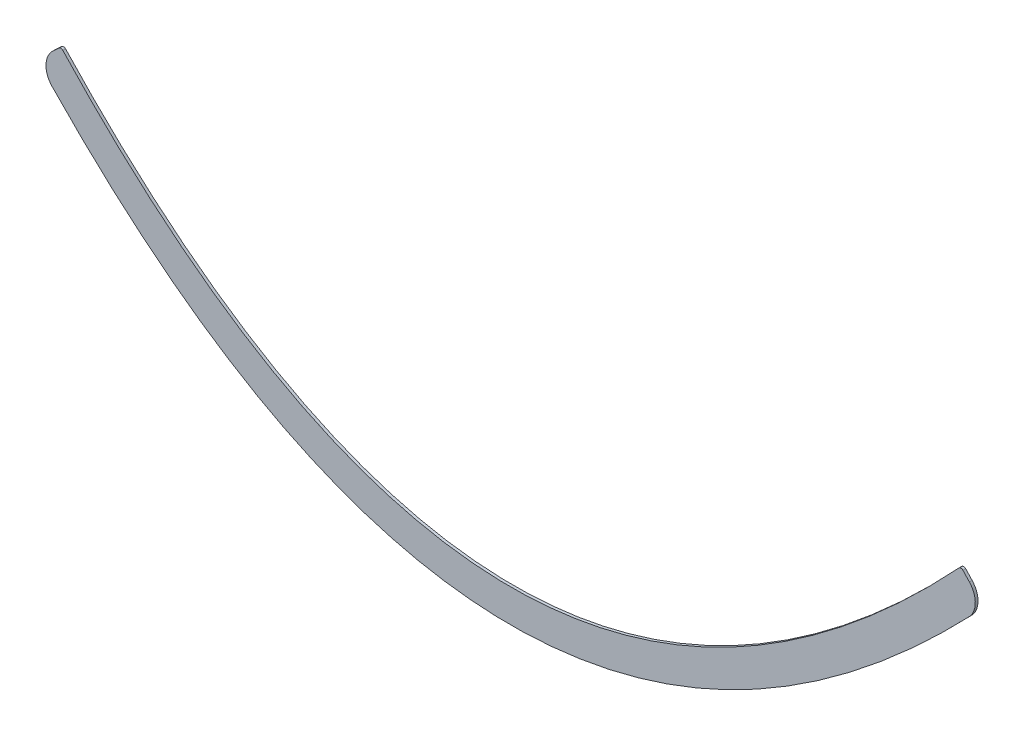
ISO-10303-21;
HEADER;
FILE_DESCRIPTION(('STEP AP214'),'2;1');
FILE_NAME('part.step','',(''),(''),'','','');
FILE_SCHEMA(('AUTOMOTIVE_DESIGN { 1 0 10303 214 1 1 1 1 }'));
ENDSEC;
DATA;
#1=APPLICATION_CONTEXT('core data for automotive mechanical design processes');
#2=APPLICATION_PROTOCOL_DEFINITION('international standard','automotive_design',2000,#1);
#3=PRODUCT_CONTEXT('',#1,'mechanical');
#4=PRODUCT('Part','Part','',(#3));
#5=PRODUCT_RELATED_PRODUCT_CATEGORY('part','',(#4));
#6=PRODUCT_DEFINITION_FORMATION('','',#4);
#7=PRODUCT_DEFINITION_CONTEXT('part definition',#1,'design');
#8=PRODUCT_DEFINITION('design','',#6,#7);
#9=PRODUCT_DEFINITION_SHAPE('','',#8);
#10=(LENGTH_UNIT() NAMED_UNIT(*) SI_UNIT(.MILLI.,.METRE.));
#11=(NAMED_UNIT(*) PLANE_ANGLE_UNIT() SI_UNIT($,.RADIAN.));
#12=(NAMED_UNIT(*) SI_UNIT($,.STERADIAN.) SOLID_ANGLE_UNIT());
#13=UNCERTAINTY_MEASURE_WITH_UNIT(LENGTH_MEASURE(1.E-05),#10,'distance_accuracy_value','');
#14=(GEOMETRIC_REPRESENTATION_CONTEXT(3) GLOBAL_UNCERTAINTY_ASSIGNED_CONTEXT((#13)) GLOBAL_UNIT_ASSIGNED_CONTEXT((#10,
#11,#12)) REPRESENTATION_CONTEXT('',''));
#15=CARTESIAN_POINT('',(0.,0.,0.));
#16=DIRECTION('',(0.,0.,1.));
#17=DIRECTION('',(1.,0.,0.));
#18=AXIS2_PLACEMENT_3D('',#15,#16,#17);
#19=CARTESIAN_POINT('',(-5.08738860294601,-74.1901727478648,6.35));
#20=CARTESIAN_POINT('',(-2.31868248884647,-77.1774609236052,6.35));
#21=CARTESIAN_POINT('',(3.23818191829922,-83.1496847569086,6.35));
#22=CARTESIAN_POINT('',(14.3358349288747,-94.983368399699,6.35));
#23=CARTESIAN_POINT('',(28.2210952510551,-109.614438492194,6.35));
#24=CARTESIAN_POINT('',(44.891224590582,-126.899363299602,6.35));
#25=CARTESIAN_POINT('',(67.1336775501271,-149.587882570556,6.35));
#26=CARTESIAN_POINT('',(94.9645082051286,-177.274594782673,6.35));
#27=CARTESIAN_POINT('',(128.408943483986,-209.420308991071,6.35));
#28=CARTESIAN_POINT('',(161.903010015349,-240.486507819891,6.35));
#29=CARTESIAN_POINT('',(206.631237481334,-280.467236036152,6.35));
#30=CARTESIAN_POINT('',(262.677880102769,-327.738120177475,6.35));
#31=CARTESIAN_POINT('',(330.171686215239,-380.121126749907,6.35));
#32=CARTESIAN_POINT('',(397.922207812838,-428.14340045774,6.35));
#33=CARTESIAN_POINT('',(465.946568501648,-471.781311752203,6.35));
#34=CARTESIAN_POINT('',(557.028254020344,-524.080170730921,6.35));
#35=CARTESIAN_POINT('',(671.622867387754,-578.335298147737,6.35));
#36=CARTESIAN_POINT('',(810.300353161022,-625.320226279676,6.35));
#37=CARTESIAN_POINT('',(949.935563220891,-653.821301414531,6.35));
#38=CARTESIAN_POINT('',(1090.12288330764,-663.54653584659,6.35));
#39=CARTESIAN_POINT('',(1230.31865120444,-654.380143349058,6.35));
#40=CARTESIAN_POINT('',(1369.9769622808,-626.431500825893,6.35));
#41=CARTESIAN_POINT('',(1508.68677291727,-579.988786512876,6.35));
#42=CARTESIAN_POINT('',(1623.3110293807,-526.176586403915,6.35));
#43=CARTESIAN_POINT('',(1714.41582364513,-474.227622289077,6.35));
#44=CARTESIAN_POINT('',(1782.45686511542,-430.850236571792,6.35));
#45=CARTESIAN_POINT('',(1850.22315077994,-383.086915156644,6.35));
#46=CARTESIAN_POINT('',(1917.73164818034,-330.961603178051,6.35));
#47=CARTESIAN_POINT('',(1973.78957422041,-283.904654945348,6.35));
#48=CARTESIAN_POINT('',(2018.52624486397,-244.094714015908,6.35));
#49=CARTESIAN_POINT('',(2052.02635465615,-213.156451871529,6.35));
#50=CARTESIAN_POINT('',(2085.47654815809,-181.138545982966,6.35));
#51=CARTESIAN_POINT('',(2113.31194486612,-153.558252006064,6.35));
#52=CARTESIAN_POINT('',(2135.55791489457,-130.954825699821,6.35));
#53=CARTESIAN_POINT('',(2152.23061523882,-113.73369854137,6.35));
#54=CARTESIAN_POINT('',(2166.11796316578,-99.1557887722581,6.35));
#55=CARTESIAN_POINT('',(2177.21725420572,-87.3646044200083,6.35));
#56=CARTESIAN_POINT('',(2182.77492650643,-81.4136672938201,6.35));
#57=CARTESIAN_POINT('',(2185.54403435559,-78.4369843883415,6.35));
#58=B_SPLINE_CURVE_WITH_KNOTS('',3,(#19,#20,#21,#22,#23,#24,#25,#26,#27,#28,#29,#30,#31,#32,#33,
#34,#35,#36,#37,#38,#39,#40,#41,#42,#43,#44,#45,#46,#47,#48,#49,#50,#51,#52,#53,#54,#55,#56,
#57),.UNSPECIFIED.,.F.,.F.,(4,1,1,1,1,1,1,1,1,1,1,1,1,1,1,1,1,1,1,1,1,1,1,1,1,1,1,1,1,1,1,1,1,1,
1,1,4),(0.488148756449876,0.48824117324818,0.488333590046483,0.488518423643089,
0.488703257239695,0.488888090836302,0.489257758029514,0.489627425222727,0.48999709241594,
0.490366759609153,0.491106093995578,0.491845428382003,0.492584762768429,0.493324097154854,
0.494063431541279,0.49554210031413,0.497020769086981,0.498499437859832,0.499978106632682,
0.501456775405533,0.502935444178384,0.504414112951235,0.505892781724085,0.506632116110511,
0.507371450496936,0.508110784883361,0.508850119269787,0.509589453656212,0.509959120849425,
0.510328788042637,0.51069845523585,0.511068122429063,0.511252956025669,0.511437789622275,
0.511622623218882,0.511715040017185,0.511807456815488),.UNSPECIFIED.);
#59=DIRECTION('',(0.,0.,-1.));
#60=VECTOR('',#59,1.);
#61=SURFACE_OF_LINEAR_EXTRUSION('',#58,#60);
#62=CARTESIAN_POINT('',(-5.08738860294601,-74.1901727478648,0.));
#63=CARTESIAN_POINT('',(-2.31868248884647,-77.1774609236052,0.));
#64=CARTESIAN_POINT('',(3.23818191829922,-83.1496847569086,0.));
#65=CARTESIAN_POINT('',(14.3358349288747,-94.983368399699,0.));
#66=CARTESIAN_POINT('',(28.2210952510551,-109.614438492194,0.));
#67=CARTESIAN_POINT('',(44.891224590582,-126.899363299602,0.));
#68=CARTESIAN_POINT('',(67.1336775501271,-149.587882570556,0.));
#69=CARTESIAN_POINT('',(94.9645082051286,-177.274594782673,0.));
#70=CARTESIAN_POINT('',(128.408943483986,-209.420308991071,0.));
#71=CARTESIAN_POINT('',(161.903010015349,-240.486507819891,0.));
#72=CARTESIAN_POINT('',(206.631237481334,-280.467236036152,0.));
#73=CARTESIAN_POINT('',(262.677880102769,-327.738120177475,0.));
#74=CARTESIAN_POINT('',(330.171686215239,-380.121126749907,0.));
#75=CARTESIAN_POINT('',(397.922207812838,-428.14340045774,0.));
#76=CARTESIAN_POINT('',(465.946568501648,-471.781311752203,0.));
#77=CARTESIAN_POINT('',(557.028254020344,-524.080170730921,0.));
#78=CARTESIAN_POINT('',(671.622867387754,-578.335298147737,0.));
#79=CARTESIAN_POINT('',(810.300353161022,-625.320226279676,0.));
#80=CARTESIAN_POINT('',(949.935563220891,-653.821301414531,0.));
#81=CARTESIAN_POINT('',(1090.12288330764,-663.54653584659,0.));
#82=CARTESIAN_POINT('',(1230.31865120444,-654.380143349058,0.));
#83=CARTESIAN_POINT('',(1369.9769622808,-626.431500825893,0.));
#84=CARTESIAN_POINT('',(1508.68677291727,-579.988786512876,0.));
#85=CARTESIAN_POINT('',(1623.3110293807,-526.176586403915,0.));
#86=CARTESIAN_POINT('',(1714.41582364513,-474.227622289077,0.));
#87=CARTESIAN_POINT('',(1782.45686511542,-430.850236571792,0.));
#88=CARTESIAN_POINT('',(1850.22315077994,-383.086915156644,0.));
#89=CARTESIAN_POINT('',(1917.73164818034,-330.961603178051,0.));
#90=CARTESIAN_POINT('',(1973.78957422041,-283.904654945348,0.));
#91=CARTESIAN_POINT('',(2018.52624486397,-244.094714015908,0.));
#92=CARTESIAN_POINT('',(2052.02635465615,-213.156451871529,0.));
#93=CARTESIAN_POINT('',(2085.47654815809,-181.138545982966,0.));
#94=CARTESIAN_POINT('',(2113.31194486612,-153.558252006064,0.));
#95=CARTESIAN_POINT('',(2135.55791489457,-130.954825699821,0.));
#96=CARTESIAN_POINT('',(2152.23061523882,-113.73369854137,0.));
#97=CARTESIAN_POINT('',(2166.11796316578,-99.1557887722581,0.));
#98=CARTESIAN_POINT('',(2177.21725420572,-87.3646044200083,0.));
#99=CARTESIAN_POINT('',(2182.77492650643,-81.4136672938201,0.));
#100=CARTESIAN_POINT('',(2185.54403435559,-78.4369843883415,0.));
#101=B_SPLINE_CURVE_WITH_KNOTS('',3,(#62,#63,#64,#65,#66,#67,#68,#69,#70,#71,#72,#73,#74,#75,
#76,#77,#78,#79,#80,#81,#82,#83,#84,#85,#86,#87,#88,#89,#90,#91,#92,#93,#94,#95,#96,#97,#98,#99,
#100),.UNSPECIFIED.,.F.,.F.,(4,1,1,1,1,1,1,1,1,1,1,1,1,1,1,1,1,1,1,1,1,1,1,1,1,1,1,1,1,1,1,1,1,
1,1,1,4),(0.488148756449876,0.48824117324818,0.488333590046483,0.488518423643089,
0.488703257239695,0.488888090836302,0.489257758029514,0.489627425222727,0.48999709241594,
0.490366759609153,0.491106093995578,0.491845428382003,0.492584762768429,0.493324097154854,
0.494063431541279,0.49554210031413,0.497020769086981,0.498499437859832,0.499978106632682,
0.501456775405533,0.502935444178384,0.504414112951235,0.505892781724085,0.506632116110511,
0.507371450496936,0.508110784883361,0.508850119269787,0.509589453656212,0.509959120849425,
0.510328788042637,0.51069845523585,0.511068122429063,0.511252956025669,0.511437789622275,
0.511622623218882,0.511715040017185,0.511807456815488),.UNSPECIFIED.);
#102=CARTESIAN_POINT('',(30.3423118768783,-111.782709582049,0.));
#103=VERTEX_POINT('',#102);
#104=CARTESIAN_POINT('',(2152.6181959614,-113.283269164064,0.));
#105=VERTEX_POINT('',#104);
#106=EDGE_CURVE('E129',#103,#105,#101,.T.);
#107=ORIENTED_EDGE('',*,*,#106,.T.);
#108=DIRECTION('',(0.,0.,-1.));
#109=VECTOR('',#108,1.);
#110=CARTESIAN_POINT('',(2152.6181959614,-113.283269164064,0.));
#111=LINE('',#110,#109);
#112=CARTESIAN_POINT('',(2152.6181959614,-113.283269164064,6.35));
#113=VERTEX_POINT('',#112);
#114=EDGE_CURVE('E53',#105,#113,#111,.F.);
#115=ORIENTED_EDGE('',*,*,#114,.T.);
#116=CARTESIAN_POINT('',(30.3423118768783,-111.782709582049,6.35));
#117=VERTEX_POINT('',#116);
#118=EDGE_CURVE('E127',#117,#113,#58,.T.);
#119=ORIENTED_EDGE('',*,*,#118,.F.);
#120=DIRECTION('',(0.,0.,-1.));
#121=VECTOR('',#120,1.);
#122=CARTESIAN_POINT('',(30.3423118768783,-111.782709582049,6.35));
#123=LINE('',#122,#121);
#124=EDGE_CURVE('E156',#117,#103,#123,.T.);
#125=ORIENTED_EDGE('',*,*,#124,.T.);
#126=EDGE_LOOP('',(#107,#115,#119,#125));
#127=FACE_BOUND('',#126,.T.);
#128=ADVANCED_FACE('F32',(#127),#61,.F.);
#129=CARTESIAN_POINT('',(2133.59999999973,-22.3921052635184,6.35));
#130=DIRECTION('',(-0.733430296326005,-0.679764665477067,0.));
#131=DIRECTION('',(0.679764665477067,-0.733430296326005,0.));
#132=AXIS2_PLACEMENT_3D('',#129,#130,#131);
#133=PLANE('',#132);
#134=DIRECTION('',(-0.679764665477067,0.733430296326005,0.));
#135=VECTOR('',#134,1.);
#136=CARTESIAN_POINT('',(2133.59999999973,-22.3921052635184,6.35));
#137=LINE('',#136,#135);
#138=CARTESIAN_POINT('',(2153.22940745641,-43.5712027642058,6.35));
#139=VERTEX_POINT('',#138);
#140=CARTESIAN_POINT('',(2138.25207451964,-27.4114488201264,6.35));
#141=VERTEX_POINT('',#140);
#142=EDGE_CURVE('E165',#139,#141,#137,.T.);
#143=ORIENTED_EDGE('',*,*,#142,.F.);
#144=DIRECTION('',(0.,0.,-1.));
#145=VECTOR('',#144,1.);
#146=CARTESIAN_POINT('',(2153.22940745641,-43.5712027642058,6.35));
#147=LINE('',#146,#145);
#148=CARTESIAN_POINT('',(2153.22940745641,-43.5712027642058,0.));
#149=VERTEX_POINT('',#148);
#150=EDGE_CURVE('E149',#139,#149,#147,.T.);
#151=ORIENTED_EDGE('',*,*,#150,.T.);
#152=DIRECTION('',(-0.679764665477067,0.733430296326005,0.));
#153=VECTOR('',#152,1.);
#154=CARTESIAN_POINT('',(2133.59999999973,-22.3921052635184,0.));
#155=LINE('',#154,#153);
#156=CARTESIAN_POINT('',(2138.25207451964,-27.4114488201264,0.));
#157=VERTEX_POINT('',#156);
#158=EDGE_CURVE('E125',#149,#157,#155,.T.);
#159=ORIENTED_EDGE('',*,*,#158,.T.);
#160=DIRECTION('',(0.,0.,-1.));
#161=VECTOR('',#160,1.);
#162=CARTESIAN_POINT('',(2138.25207451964,-27.4114488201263,6.35));
#163=LINE('',#162,#161);
#164=EDGE_CURVE('E106',#157,#141,#163,.F.);
#165=ORIENTED_EDGE('',*,*,#164,.T.);
#166=EDGE_LOOP('',(#143,#151,#159,#165));
#167=FACE_BOUND('',#166,.T.);
#168=ADVANCED_FACE('F169',(#167),#133,.F.);
#169=CARTESIAN_POINT('',(45028.5175516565,999415.8,6.35));
#170=CARTESIAN_POINT('',(1092.2,-1000584.2,6.35));
#171=CARTESIAN_POINT('',(-42844.1175516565,999415.8,6.35));
#172=B_SPLINE_CURVE_WITH_KNOTS('',2,(#169,#170,#171),.UNSPECIFIED.,.F.,.F.,(3,3),(0.,1.),.UNSPECIFIED.);
#173=DIRECTION('',(0.,0.,-1.));
#174=VECTOR('',#173,1.);
#175=SURFACE_OF_LINEAR_EXTRUSION('',#172,#174);
#176=CARTESIAN_POINT('',(2128.9471595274,-27.4010605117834,6.35));
#177=VERTEX_POINT('',#176);
#178=CARTESIAN_POINT('',(55.1123771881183,-27.0352997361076,6.35));
#179=VERTEX_POINT('',#178);
#180=EDGE_CURVE('E119',#177,#179,#172,.T.);
#181=ORIENTED_EDGE('',*,*,#180,.F.);
#182=DIRECTION('',(0.,0.,-1.));
#183=VECTOR('',#182,1.);
#184=CARTESIAN_POINT('',(2128.94715952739,-27.4010605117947,6.35));
#185=LINE('',#184,#183);
#186=CARTESIAN_POINT('',(2128.94715952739,-27.4010605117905,0.));
#187=VERTEX_POINT('',#186);
#188=EDGE_CURVE('E104',#177,#187,#185,.T.);
#189=ORIENTED_EDGE('',*,*,#188,.T.);
#190=CARTESIAN_POINT('',(45028.5175516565,999415.8,0.));
#191=CARTESIAN_POINT('',(1092.2,-1000584.2,0.));
#192=CARTESIAN_POINT('',(-42844.1175516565,999415.8,0.));
#193=B_SPLINE_CURVE_WITH_KNOTS('',2,(#190,#191,#192),.UNSPECIFIED.,.F.,.F.,(3,3),(0.,1.),.UNSPECIFIED.);
#194=CARTESIAN_POINT('',(55.1123771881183,-27.0352997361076,0.));
#195=VERTEX_POINT('',#194);
#196=EDGE_CURVE('E116',#187,#195,#193,.T.);
#197=ORIENTED_EDGE('',*,*,#196,.T.);
#198=DIRECTION('',(0.,0.,-1.));
#199=VECTOR('',#198,1.);
#200=CARTESIAN_POINT('',(55.1123771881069,-27.0352997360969,0.));
#201=LINE('',#200,#199);
#202=EDGE_CURVE('E120',#195,#179,#201,.F.);
#203=ORIENTED_EDGE('',*,*,#202,.T.);
#204=EDGE_LOOP('',(#181,#189,#197,#203));
#205=FACE_BOUND('',#204,.T.);
#206=ADVANCED_FACE('F115',(#205),#175,.F.);
#207=CARTESIAN_POINT('',(50.8000000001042,-22.3921052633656,6.35));
#208=DIRECTION('',(0.679764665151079,-0.73343029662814,0.));
#209=DIRECTION('',(0.73343029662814,0.679764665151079,0.));
#210=AXIS2_PLACEMENT_3D('',#207,#208,#209);
#211=PLANE('',#210);
#212=DIRECTION('',(-0.73343029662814,-0.679764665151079,0.));
#213=VECTOR('',#212,1.);
#214=CARTESIAN_POINT('',(50.8000000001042,-22.3921052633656,0.));
#215=LINE('',#214,#213);
#216=CARTESIAN_POINT('',(46.1475304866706,-26.7041501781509,0.));
#217=VERTEX_POINT('',#216);
#218=CARTESIAN_POINT('',(32.4817977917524,-39.3699512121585,0.));
#219=VERTEX_POINT('',#218);
#220=EDGE_CURVE('E124',#217,#219,#215,.T.);
#221=ORIENTED_EDGE('',*,*,#220,.T.);
#222=DIRECTION('',(0.,0.,-1.));
#223=VECTOR('',#222,1.);
#224=CARTESIAN_POINT('',(32.4817977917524,-39.3699512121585,6.35));
#225=LINE('',#224,#223);
#226=CARTESIAN_POINT('',(32.4817977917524,-39.3699512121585,6.35));
#227=VERTEX_POINT('',#226);
#228=EDGE_CURVE('E11',#219,#227,#225,.F.);
#229=ORIENTED_EDGE('',*,*,#228,.T.);
#230=DIRECTION('',(-0.73343029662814,-0.679764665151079,0.));
#231=VECTOR('',#230,1.);
#232=CARTESIAN_POINT('',(50.8000000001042,-22.3921052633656,6.35));
#233=LINE('',#232,#231);
#234=CARTESIAN_POINT('',(46.1475304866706,-26.7041501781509,6.35));
#235=VERTEX_POINT('',#234);
#236=EDGE_CURVE('E138',#235,#227,#233,.T.);
#237=ORIENTED_EDGE('',*,*,#236,.F.);
#238=DIRECTION('',(0.,0.,-1.));
#239=VECTOR('',#238,1.);
#240=CARTESIAN_POINT('',(46.1475304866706,-26.7041501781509,6.35));
#241=LINE('',#240,#239);
#242=EDGE_CURVE('E146',#235,#217,#241,.T.);
#243=ORIENTED_EDGE('',*,*,#242,.T.);
#244=EDGE_LOOP('',(#221,#229,#237,#243));
#245=FACE_BOUND('',#244,.T.);
#246=ADVANCED_FACE('F192',(#245),#211,.F.);
#247=CARTESIAN_POINT('',(1090.12429127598,-660.397931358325,6.35));
#248=DIRECTION('',(0.,0.,-1.));
#249=DIRECTION('',(-1.,0.,0.));
#250=AXIS2_PLACEMENT_3D('',#247,#248,#249);
#251=PLANE('',#250);
#252=ORIENTED_EDGE('',*,*,#118,.T.);
#253=CARTESIAN_POINT('',(2115.97114840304,-78.1032477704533,6.35));
#254=DIRECTION('',(0.,0.,-1.));
#255=DIRECTION('',(-1.,0.,0.));
#256=AXIS2_PLACEMENT_3D('',#253,#254,#255);
#257=CIRCLE('',#256,50.8);
#258=EDGE_CURVE('E40',#113,#139,#257,.F.);
#259=ORIENTED_EDGE('',*,*,#258,.T.);
#260=ORIENTED_EDGE('',*,*,#142,.T.);
#261=CARTESIAN_POINT('',(2133.59479213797,-31.7279544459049,6.35));
#262=DIRECTION('',(0.,0.,-1.));
#263=DIRECTION('',(-1.,0.,0.));
#264=AXIS2_PLACEMENT_3D('',#261,#262,#263);
#265=CIRCLE('',#264,6.35);
#266=EDGE_CURVE('E144',#141,#177,#265,.F.);
#267=ORIENTED_EDGE('',*,*,#266,.T.);
#268=ORIENTED_EDGE('',*,*,#180,.T.);
#269=CARTESIAN_POINT('',(50.4640361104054,-31.3614325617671,6.35));
#270=DIRECTION('',(0.,0.,-1.));
#271=DIRECTION('',(-1.,0.,0.));
#272=AXIS2_PLACEMENT_3D('',#269,#270,#271);
#273=CIRCLE('',#272,6.35);
#274=EDGE_CURVE('E142',#179,#235,#273,.F.);
#275=ORIENTED_EDGE('',*,*,#274,.T.);
#276=ORIENTED_EDGE('',*,*,#236,.T.);
#277=CARTESIAN_POINT('',(67.0138427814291,-76.6282102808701,6.35));
#278=DIRECTION('',(0.,0.,-1.));
#279=DIRECTION('',(-1.,0.,0.));
#280=AXIS2_PLACEMENT_3D('',#277,#278,#279);
#281=CIRCLE('',#280,50.8);
#282=EDGE_CURVE('E160',#227,#117,#281,.F.);
#283=ORIENTED_EDGE('',*,*,#282,.T.);
#284=EDGE_LOOP('',(#252,#259,#260,#267,#268,#275,#276,#283));
#285=FACE_BOUND('',#284,.T.);
#286=ADVANCED_FACE('F164',(#285),#251,.F.);
#287=CARTESIAN_POINT('',(1090.12429127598,-660.397931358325,0.));
#288=DIRECTION('',(0.,0.,-1.));
#289=DIRECTION('',(-1.,0.,0.));
#290=AXIS2_PLACEMENT_3D('',#287,#288,#289);
#291=PLANE('',#290);
#292=ORIENTED_EDGE('',*,*,#158,.F.);
#293=CARTESIAN_POINT('',(2115.97114840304,-78.1032477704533,0.));
#294=DIRECTION('',(0.,0.,-1.));
#295=DIRECTION('',(-1.,0.,0.));
#296=AXIS2_PLACEMENT_3D('',#293,#294,#295);
#297=CIRCLE('',#296,50.8);
#298=EDGE_CURVE('E154',#149,#105,#297,.T.);
#299=ORIENTED_EDGE('',*,*,#298,.T.);
#300=ORIENTED_EDGE('',*,*,#106,.F.);
#301=CARTESIAN_POINT('',(67.0138427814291,-76.6282102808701,0.));
#302=DIRECTION('',(0.,0.,-1.));
#303=DIRECTION('',(-1.,0.,0.));
#304=AXIS2_PLACEMENT_3D('',#301,#302,#303);
#305=CIRCLE('',#304,50.8);
#306=EDGE_CURVE('E152',#103,#219,#305,.T.);
#307=ORIENTED_EDGE('',*,*,#306,.T.);
#308=ORIENTED_EDGE('',*,*,#220,.F.);
#309=CARTESIAN_POINT('',(50.4640361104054,-31.3614325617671,0.));
#310=DIRECTION('',(0.,0.,-1.));
#311=DIRECTION('',(-1.,0.,0.));
#312=AXIS2_PLACEMENT_3D('',#309,#310,#311);
#313=CIRCLE('',#312,6.35);
#314=EDGE_CURVE('E110',#217,#195,#313,.T.);
#315=ORIENTED_EDGE('',*,*,#314,.T.);
#316=ORIENTED_EDGE('',*,*,#196,.F.);
#317=CARTESIAN_POINT('',(2133.59479213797,-31.7279544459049,0.));
#318=DIRECTION('',(0.,0.,-1.));
#319=DIRECTION('',(-1.,0.,0.));
#320=AXIS2_PLACEMENT_3D('',#317,#318,#319);
#321=CIRCLE('',#320,6.35);
#322=EDGE_CURVE('E100',#187,#157,#321,.T.);
#323=ORIENTED_EDGE('',*,*,#322,.T.);
#324=EDGE_LOOP('',(#292,#299,#300,#307,#308,#315,#316,#323));
#325=FACE_BOUND('',#324,.T.);
#326=ADVANCED_FACE('F122',(#325),#291,.T.);
#327=CARTESIAN_POINT('',(2133.59479213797,-31.7279544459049,3.175));
#328=DIRECTION('',(0.,0.,-1.));
#329=DIRECTION('',(-1.,0.,0.));
#330=AXIS2_PLACEMENT_3D('',#327,#328,#329);
#331=CYLINDRICAL_SURFACE('',#330,6.35);
#332=ORIENTED_EDGE('',*,*,#266,.F.);
#333=ORIENTED_EDGE('',*,*,#164,.F.);
#334=ORIENTED_EDGE('',*,*,#322,.F.);
#335=ORIENTED_EDGE('',*,*,#188,.F.);
#336=EDGE_LOOP('',(#332,#333,#334,#335));
#337=FACE_BOUND('',#336,.T.);
#338=ADVANCED_FACE('F103',(#337),#331,.T.);
#339=CARTESIAN_POINT('',(50.4640361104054,-31.3614325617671,3.175));
#340=DIRECTION('',(0.,0.,-1.));
#341=DIRECTION('',(-1.,0.,0.));
#342=AXIS2_PLACEMENT_3D('',#339,#340,#341);
#343=CYLINDRICAL_SURFACE('',#342,6.35);
#344=ORIENTED_EDGE('',*,*,#274,.F.);
#345=ORIENTED_EDGE('',*,*,#202,.F.);
#346=ORIENTED_EDGE('',*,*,#314,.F.);
#347=ORIENTED_EDGE('',*,*,#242,.F.);
#348=EDGE_LOOP('',(#344,#345,#346,#347));
#349=FACE_BOUND('',#348,.T.);
#350=ADVANCED_FACE('F206',(#349),#343,.T.);
#351=CARTESIAN_POINT('',(2115.97114840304,-78.1032477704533,3.175));
#352=DIRECTION('',(0.,0.,-1.));
#353=DIRECTION('',(-1.,0.,0.));
#354=AXIS2_PLACEMENT_3D('',#351,#352,#353);
#355=CYLINDRICAL_SURFACE('',#354,50.8);
#356=ORIENTED_EDGE('',*,*,#258,.F.);
#357=ORIENTED_EDGE('',*,*,#114,.F.);
#358=ORIENTED_EDGE('',*,*,#298,.F.);
#359=ORIENTED_EDGE('',*,*,#150,.F.);
#360=EDGE_LOOP('',(#356,#357,#358,#359));
#361=FACE_BOUND('',#360,.T.);
#362=ADVANCED_FACE('F171',(#361),#355,.T.);
#363=CARTESIAN_POINT('',(67.0138427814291,-76.6282102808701,3.175));
#364=DIRECTION('',(0.,0.,-1.));
#365=DIRECTION('',(-1.,0.,0.));
#366=AXIS2_PLACEMENT_3D('',#363,#364,#365);
#367=CYLINDRICAL_SURFACE('',#366,50.8);
#368=ORIENTED_EDGE('',*,*,#282,.F.);
#369=ORIENTED_EDGE('',*,*,#228,.F.);
#370=ORIENTED_EDGE('',*,*,#306,.F.);
#371=ORIENTED_EDGE('',*,*,#124,.F.);
#372=EDGE_LOOP('',(#368,#369,#370,#371));
#373=FACE_BOUND('',#372,.T.);
#374=ADVANCED_FACE('F34',(#373),#367,.T.);
#375=CLOSED_SHELL('',(#128,#168,#206,#246,#286,#326,#338,#350,#362,#374));
#376=MANIFOLD_SOLID_BREP('B2',#375);
#377=ADVANCED_BREP_SHAPE_REPRESENTATION('',(#18,#376),#14);
#378=SHAPE_DEFINITION_REPRESENTATION(#9,#377);
ENDSEC;
END-ISO-10303-21;
